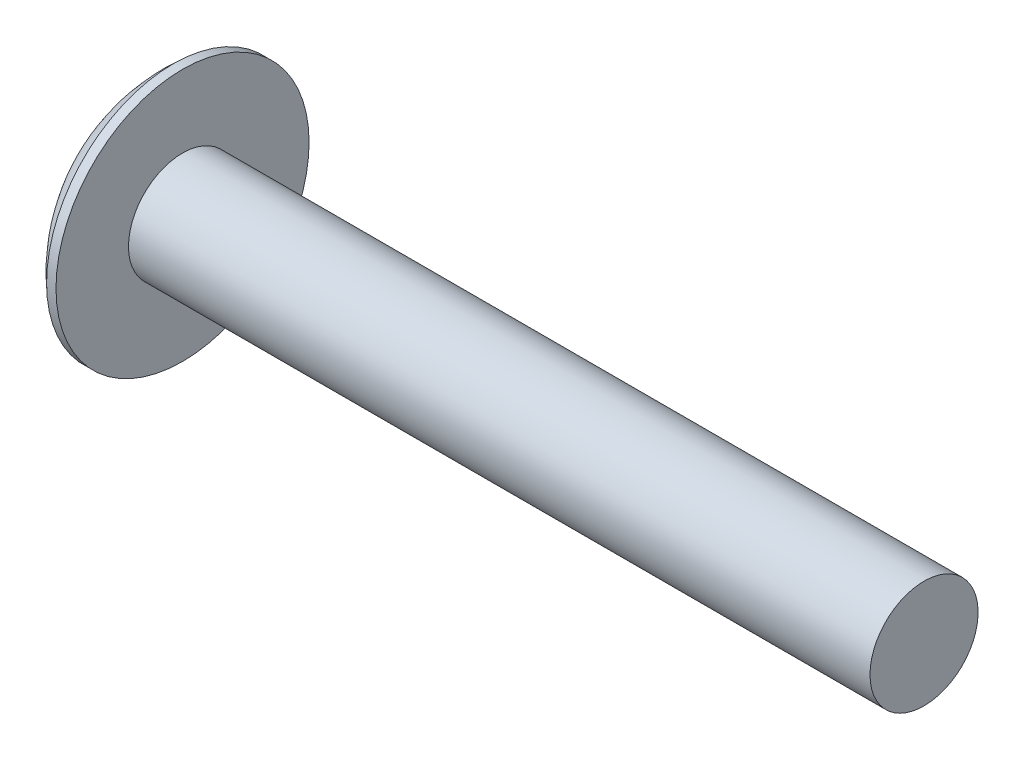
from build123d import *

# Parameters (mm, degrees)
CIRPATTERN1_COUNT = 2
CIRPATTERN1_ANGLE = 90


with BuildPart() as part:
    # BodySke → Base-Revolve (revolve)
    with BuildSketch(Plane.XY, mode=Mode.PRIVATE) as base_revolve_sk:
        with BuildLine():
            Line((2.5908, 2.0828), (2.5908, 4.8768))
            Line((2.5908, 4.8768), (2.227861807, 4.8768))
            ThreePointArc((2.227861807, 4.8768), (0.5833374, 2.680790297), (0, 0))
            Line((0, 0), (31.1658, 0))
            Line((31.1658, 0), (31.1658, 2.0828))
            Line((31.1658, 2.0828), (2.5908, 2.0828))
        make_face()
    revolve(base_revolve_sk.sketch.rotate(Axis((-25.4, 0, 0), (1, 0, 0)), 90), axis=Axis((-25.4, 0, 0), (1, 0, 0)))

    # Sketch3 → Cross section 0
    with BuildSketch(Plane(origin=(0, 0, 0), x_dir=(0, 0, -1), z_dir=(1, 0, 0))):
        with BuildLine():
            Line((0.5207, -2.7305), (-0.5207, -2.7305))
            Line((-0.5207, -2.7305), (-0.5207, 2.7305))
            Line((-0.5207, 2.7305), (0.5207, 2.7305))
            Line((0.5207, 2.7305), (0.5207, -2.7305))
        make_face()
    # Sketch4 → Cross section 1
    with BuildSketch(Plane(origin=(3.0734, 0, 0), x_dir=(0, 0, -1), z_dir=(1, 0, 0))):
        with BuildLine():
            Line((0.26035, -0.26035), (-0.26035, -0.26035))
            Line((-0.26035, -0.26035), (-0.26035, 0.26035))
            Line((-0.26035, 0.26035), (0.26035, 0.26035))
            Line((0.26035, 0.26035), (0.26035, -0.26035))
        make_face()
    cross = loft(mode=Mode.SUBTRACT)

    # CirPattern1: Cross ×2 about axis
    cirpattern1_axis = Axis((0, 0, 0), (1, 0, 0))
    for i in range(1, CIRPATTERN1_COUNT):
        add(cross.rotate(cirpattern1_axis, i * CIRPATTERN1_ANGLE / (CIRPATTERN1_COUNT - 1)), mode=Mode.SUBTRACT)


solid = part.part
